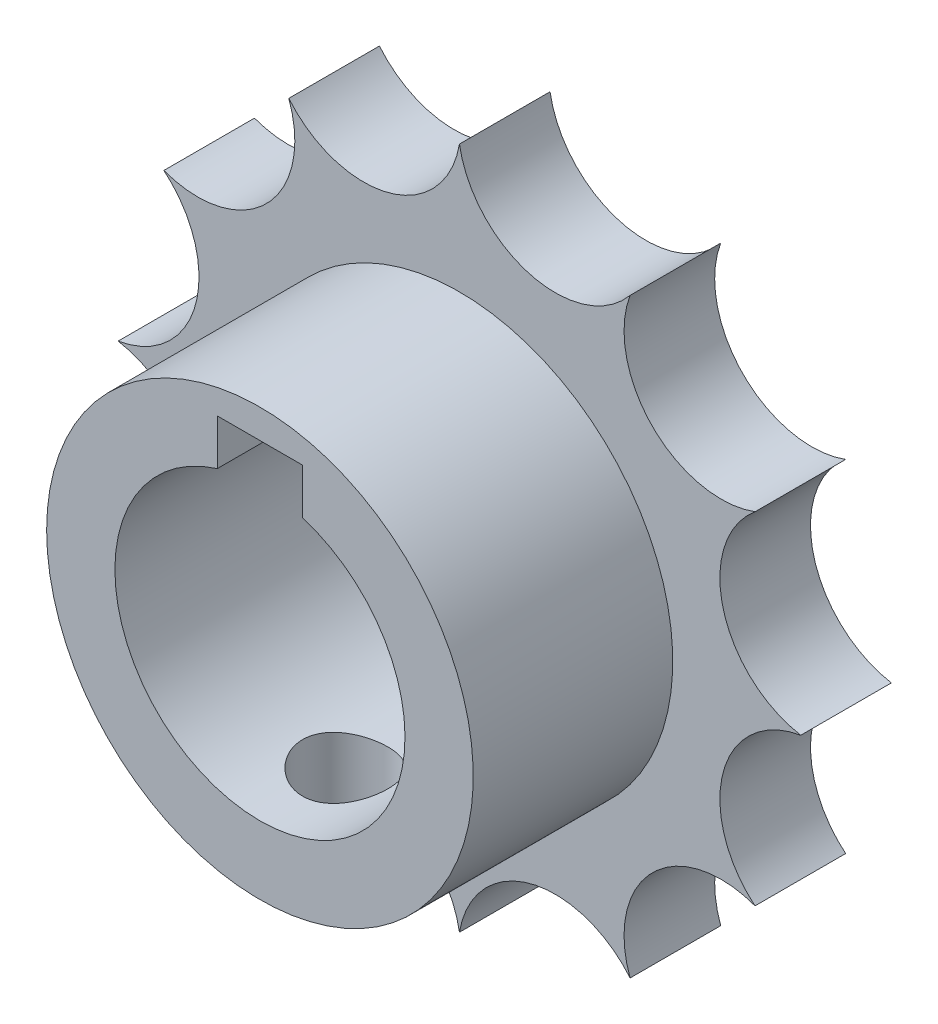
ISO-10303-21;
HEADER;
FILE_DESCRIPTION(('STEP AP214'),'2;1');
FILE_NAME('part.step','',(''),(''),'','','');
FILE_SCHEMA(('AUTOMOTIVE_DESIGN { 1 0 10303 214 1 1 1 1 }'));
ENDSEC;
DATA;
#1=APPLICATION_CONTEXT('core data for automotive mechanical design processes');
#2=APPLICATION_PROTOCOL_DEFINITION('international standard','automotive_design',2000,#1);
#3=PRODUCT_CONTEXT('',#1,'mechanical');
#4=PRODUCT('Part','Part','',(#3));
#5=PRODUCT_RELATED_PRODUCT_CATEGORY('part','',(#4));
#6=PRODUCT_DEFINITION_FORMATION('','',#4);
#7=PRODUCT_DEFINITION_CONTEXT('part definition',#1,'design');
#8=PRODUCT_DEFINITION('design','',#6,#7);
#9=PRODUCT_DEFINITION_SHAPE('','',#8);
#10=(LENGTH_UNIT() NAMED_UNIT(*) SI_UNIT(.MILLI.,.METRE.));
#11=(NAMED_UNIT(*) PLANE_ANGLE_UNIT() SI_UNIT($,.RADIAN.));
#12=(NAMED_UNIT(*) SI_UNIT($,.STERADIAN.) SOLID_ANGLE_UNIT());
#13=UNCERTAINTY_MEASURE_WITH_UNIT(LENGTH_MEASURE(1.E-05),#10,'distance_accuracy_value','');
#14=(GEOMETRIC_REPRESENTATION_CONTEXT(3) GLOBAL_UNCERTAINTY_ASSIGNED_CONTEXT((#13)) GLOBAL_UNIT_ASSIGNED_CONTEXT((#10,
#11,#12)) REPRESENTATION_CONTEXT('',''));
#15=CARTESIAN_POINT('',(0.,0.,0.));
#16=DIRECTION('',(0.,0.,1.));
#17=DIRECTION('',(1.,0.,0.));
#18=AXIS2_PLACEMENT_3D('',#15,#16,#17);
#19=CARTESIAN_POINT('',(-12.2034547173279,-7.35647207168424,0.));
#20=DIRECTION('',(0.,0.,-1.));
#21=DIRECTION('',(-1.,0.,0.));
#22=AXIS2_PLACEMENT_3D('',#19,#20,#21);
#23=PLANE('',#22);
#24=DIRECTION('',(0.,1.,0.));
#25=VECTOR('',#24,1.);
#26=CARTESIAN_POINT('',(-9.70345471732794,3.44352792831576,0.));
#27=LINE('',#26,#25);
#28=CARTESIAN_POINT('',(-9.70345471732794,0.767566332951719,0.));
#29=VERTEX_POINT('',#28);
#30=CARTESIAN_POINT('',(-9.70345471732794,3.44352792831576,0.));
#31=VERTEX_POINT('',#30);
#32=EDGE_CURVE('E151',#29,#31,#27,.T.);
#33=ORIENTED_EDGE('',*,*,#32,.T.);
#34=DIRECTION('',(1.,0.,0.));
#35=VECTOR('',#34,1.);
#36=CARTESIAN_POINT('',(-14.7034547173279,3.44352792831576,0.));
#37=LINE('',#36,#35);
#38=CARTESIAN_POINT('',(-14.7034547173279,3.44352792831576,0.));
#39=VERTEX_POINT('',#38);
#40=EDGE_CURVE('E199',#31,#39,#37,.F.);
#41=ORIENTED_EDGE('',*,*,#40,.T.);
#42=DIRECTION('',(0.,1.,0.));
#43=VECTOR('',#42,1.);
#44=CARTESIAN_POINT('',(-14.7034547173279,0.767566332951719,0.));
#45=LINE('',#44,#43);
#46=CARTESIAN_POINT('',(-14.7034547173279,0.767566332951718,0.));
#47=VERTEX_POINT('',#46);
#48=EDGE_CURVE('E195',#39,#47,#45,.F.);
#49=ORIENTED_EDGE('',*,*,#48,.T.);
#50=CARTESIAN_POINT('',(-12.2034547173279,-7.35647207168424,0.));
#51=DIRECTION('',(0.,0.,1.));
#52=DIRECTION('',(1.,0.,0.));
#53=AXIS2_PLACEMENT_3D('',#50,#51,#52);
#54=CIRCLE('',#53,8.5);
#55=EDGE_CURVE('E149',#47,#29,#54,.T.);
#56=ORIENTED_EDGE('',*,*,#55,.T.);
#57=EDGE_LOOP('',(#33,#41,#49,#56));
#58=FACE_BOUND('',#57,.T.);
#59=CARTESIAN_POINT('',(-27.5451557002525,7.98522891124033,0.));
#60=DIRECTION('',(0.,0.,1.));
#61=DIRECTION('',(1.,0.,0.));
#62=AXIS2_PLACEMENT_3D('',#59,#60,#61);
#63=CIRCLE('',#62,5.69644159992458);
#64=CARTESIAN_POINT('',(-29.5239627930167,2.64352792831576,0.));
#65=VERTEX_POINT('',#64);
#66=CARTESIAN_POINT('',(-22.2034547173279,9.96403600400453,0.));
#67=VERTEX_POINT('',#66);
#68=EDGE_CURVE('E161',#65,#67,#63,.T.);
#69=ORIENTED_EDGE('',*,*,#68,.T.);
#70=CARTESIAN_POINT('',(-17.818907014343,13.6006812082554,0.));
#71=DIRECTION('',(0.,0.,1.));
#72=DIRECTION('',(1.,0.,0.));
#73=AXIS2_PLACEMENT_3D('',#70,#71,#72);
#74=CIRCLE('',#73,5.69644159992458);
#75=CARTESIAN_POINT('',(-12.2034547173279,12.6435279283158,0.));
#76=VERTEX_POINT('',#75);
#77=EDGE_CURVE('E131',#67,#76,#74,.T.);
#78=ORIENTED_EDGE('',*,*,#77,.T.);
#79=CARTESIAN_POINT('',(-6.58800242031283,13.6006812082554,0.));
#80=DIRECTION('',(0.,0.,1.));
#81=DIRECTION('',(1.,0.,0.));
#82=AXIS2_PLACEMENT_3D('',#79,#80,#81);
#83=CIRCLE('',#82,5.69644159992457);
#84=CARTESIAN_POINT('',(-2.20345471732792,9.96403600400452,0.));
#85=VERTEX_POINT('',#84);
#86=EDGE_CURVE('E127',#76,#85,#83,.T.);
#87=ORIENTED_EDGE('',*,*,#86,.T.);
#88=CARTESIAN_POINT('',(3.13824626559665,7.98522891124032,0.));
#89=DIRECTION('',(0.,0.,1.));
#90=DIRECTION('',(1.,0.,0.));
#91=AXIS2_PLACEMENT_3D('',#88,#89,#90);
#92=CIRCLE('',#91,5.69644159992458);
#93=CARTESIAN_POINT('',(5.11705335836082,2.64352792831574,0.));
#94=VERTEX_POINT('',#93);
#95=EDGE_CURVE('E19',#85,#94,#92,.T.);
#96=ORIENTED_EDGE('',*,*,#95,.T.);
#97=CARTESIAN_POINT('',(8.75369856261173,-1.74101977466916,0.));
#98=DIRECTION('',(0.,0.,1.));
#99=DIRECTION('',(1.,0.,0.));
#100=AXIS2_PLACEMENT_3D('',#97,#98,#99);
#101=CIRCLE('',#100,5.69644159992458);
#102=CARTESIAN_POINT('',(7.79654528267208,-7.35647207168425,0.));
#103=VERTEX_POINT('',#102);
#104=EDGE_CURVE('E193',#94,#103,#101,.T.);
#105=ORIENTED_EDGE('',*,*,#104,.T.);
#106=CARTESIAN_POINT('',(8.75369856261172,-12.9719243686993,0.));
#107=DIRECTION('',(0.,0.,1.));
#108=DIRECTION('',(1.,0.,0.));
#109=AXIS2_PLACEMENT_3D('',#106,#107,#108);
#110=CIRCLE('',#109,5.69644159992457);
#111=CARTESIAN_POINT('',(5.11705335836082,-17.3564720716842,0.));
#112=VERTEX_POINT('',#111);
#113=EDGE_CURVE('E189',#103,#112,#110,.T.);
#114=ORIENTED_EDGE('',*,*,#113,.T.);
#115=CARTESIAN_POINT('',(3.13824626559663,-22.6981730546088,0.));
#116=DIRECTION('',(0.,0.,1.));
#117=DIRECTION('',(1.,0.,0.));
#118=AXIS2_PLACEMENT_3D('',#115,#116,#117);
#119=CIRCLE('',#118,5.69644159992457);
#120=CARTESIAN_POINT('',(-2.20345471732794,-24.676980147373,0.));
#121=VERTEX_POINT('',#120);
#122=EDGE_CURVE('E185',#112,#121,#119,.T.);
#123=ORIENTED_EDGE('',*,*,#122,.T.);
#124=CARTESIAN_POINT('',(-6.58800242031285,-28.3136253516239,0.));
#125=DIRECTION('',(0.,0.,1.));
#126=DIRECTION('',(1.,0.,0.));
#127=AXIS2_PLACEMENT_3D('',#124,#125,#126);
#128=CIRCLE('',#127,5.69644159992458);
#129=CARTESIAN_POINT('',(-12.2034547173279,-27.3564720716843,0.));
#130=VERTEX_POINT('',#129);
#131=EDGE_CURVE('E181',#121,#130,#128,.T.);
#132=ORIENTED_EDGE('',*,*,#131,.T.);
#133=CARTESIAN_POINT('',(-17.818907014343,-28.3136253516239,0.));
#134=DIRECTION('',(0.,0.,1.));
#135=DIRECTION('',(1.,0.,0.));
#136=AXIS2_PLACEMENT_3D('',#133,#134,#135);
#137=CIRCLE('',#136,5.69644159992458);
#138=CARTESIAN_POINT('',(-22.2034547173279,-24.676980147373,0.));
#139=VERTEX_POINT('',#138);
#140=EDGE_CURVE('E177',#130,#139,#137,.T.);
#141=ORIENTED_EDGE('',*,*,#140,.T.);
#142=CARTESIAN_POINT('',(-27.5451557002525,-22.6981730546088,0.));
#143=DIRECTION('',(0.,0.,1.));
#144=DIRECTION('',(1.,0.,0.));
#145=AXIS2_PLACEMENT_3D('',#142,#143,#144);
#146=CIRCLE('',#145,5.69644159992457);
#147=CARTESIAN_POINT('',(-29.5239627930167,-17.3564720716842,0.));
#148=VERTEX_POINT('',#147);
#149=EDGE_CURVE('E173',#139,#148,#146,.T.);
#150=ORIENTED_EDGE('',*,*,#149,.T.);
#151=CARTESIAN_POINT('',(-33.1606079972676,-12.9719243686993,0.));
#152=DIRECTION('',(0.,0.,1.));
#153=DIRECTION('',(1.,0.,0.));
#154=AXIS2_PLACEMENT_3D('',#151,#152,#153);
#155=CIRCLE('',#154,5.69644159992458);
#156=CARTESIAN_POINT('',(-32.2034547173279,-7.35647207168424,0.));
#157=VERTEX_POINT('',#156);
#158=EDGE_CURVE('E169',#148,#157,#155,.T.);
#159=ORIENTED_EDGE('',*,*,#158,.T.);
#160=CARTESIAN_POINT('',(-33.1606079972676,-1.74101977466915,0.));
#161=DIRECTION('',(0.,0.,1.));
#162=DIRECTION('',(1.,0.,0.));
#163=AXIS2_PLACEMENT_3D('',#160,#161,#162);
#164=CIRCLE('',#163,5.69644159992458);
#165=EDGE_CURVE('E165',#157,#65,#164,.T.);
#166=ORIENTED_EDGE('',*,*,#165,.T.);
#167=EDGE_LOOP('',(#69,#78,#87,#96,#105,#114,#123,#132,#141,#150,#159,#166));
#168=FACE_BOUND('',#167,.T.);
#169=ADVANCED_FACE('F16',(#58,#168),#23,.T.);
#170=CARTESIAN_POINT('',(3.13824626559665,7.98522891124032,0.));
#171=DIRECTION('',(0.,0.,1.));
#172=DIRECTION('',(1.,0.,0.));
#173=AXIS2_PLACEMENT_3D('',#170,#171,#172);
#174=CYLINDRICAL_SURFACE('',#173,5.69644159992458);
#175=DIRECTION('',(0.,0.,1.));
#176=VECTOR('',#175,1.);
#177=CARTESIAN_POINT('',(5.11705335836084,2.64352792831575,0.));
#178=LINE('',#177,#176);
#179=CARTESIAN_POINT('',(5.11705335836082,2.64352792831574,5.31));
#180=VERTEX_POINT('',#179);
#181=EDGE_CURVE('E143',#180,#94,#178,.F.);
#182=ORIENTED_EDGE('',*,*,#181,.T.);
#183=ORIENTED_EDGE('',*,*,#95,.F.);
#184=DIRECTION('',(0.,0.,1.));
#185=VECTOR('',#184,1.);
#186=CARTESIAN_POINT('',(-2.20345471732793,9.96403600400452,0.));
#187=LINE('',#186,#185);
#188=CARTESIAN_POINT('',(-2.20345471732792,9.96403600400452,5.31));
#189=VERTEX_POINT('',#188);
#190=EDGE_CURVE('E136',#85,#189,#187,.T.);
#191=ORIENTED_EDGE('',*,*,#190,.T.);
#192=CARTESIAN_POINT('',(3.13824626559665,7.98522891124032,5.31));
#193=DIRECTION('',(0.,0.,1.));
#194=DIRECTION('',(1.,0.,0.));
#195=AXIS2_PLACEMENT_3D('',#192,#193,#194);
#196=CIRCLE('',#195,5.69644159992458);
#197=EDGE_CURVE('E250',#189,#180,#196,.T.);
#198=ORIENTED_EDGE('',*,*,#197,.T.);
#199=EDGE_LOOP('',(#182,#183,#191,#198));
#200=FACE_BOUND('',#199,.T.);
#201=ADVANCED_FACE('F140',(#200),#174,.F.);
#202=CARTESIAN_POINT('',(8.75369856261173,-1.74101977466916,0.));
#203=DIRECTION('',(0.,0.,1.));
#204=DIRECTION('',(1.,0.,0.));
#205=AXIS2_PLACEMENT_3D('',#202,#203,#204);
#206=CYLINDRICAL_SURFACE('',#205,5.69644159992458);
#207=DIRECTION('',(0.,0.,1.));
#208=VECTOR('',#207,1.);
#209=CARTESIAN_POINT('',(7.79654528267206,-7.35647207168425,0.));
#210=LINE('',#209,#208);
#211=CARTESIAN_POINT('',(7.79654528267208,-7.35647207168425,5.31));
#212=VERTEX_POINT('',#211);
#213=EDGE_CURVE('E190',#212,#103,#210,.F.);
#214=ORIENTED_EDGE('',*,*,#213,.T.);
#215=ORIENTED_EDGE('',*,*,#104,.F.);
#216=ORIENTED_EDGE('',*,*,#181,.F.);
#217=CARTESIAN_POINT('',(8.75369856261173,-1.74101977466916,5.31));
#218=DIRECTION('',(0.,0.,1.));
#219=DIRECTION('',(1.,0.,0.));
#220=AXIS2_PLACEMENT_3D('',#217,#218,#219);
#221=CIRCLE('',#220,5.69644159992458);
#222=EDGE_CURVE('E437',#180,#212,#221,.T.);
#223=ORIENTED_EDGE('',*,*,#222,.T.);
#224=EDGE_LOOP('',(#214,#215,#216,#223));
#225=FACE_BOUND('',#224,.T.);
#226=ADVANCED_FACE('F315',(#225),#206,.F.);
#227=CARTESIAN_POINT('',(8.75369856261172,-12.9719243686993,0.));
#228=DIRECTION('',(0.,0.,1.));
#229=DIRECTION('',(1.,0.,0.));
#230=AXIS2_PLACEMENT_3D('',#227,#228,#229);
#231=CYLINDRICAL_SURFACE('',#230,5.69644159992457);
#232=DIRECTION('',(0.,0.,1.));
#233=VECTOR('',#232,1.);
#234=CARTESIAN_POINT('',(5.11705335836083,-17.3564720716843,0.));
#235=LINE('',#234,#233);
#236=CARTESIAN_POINT('',(5.11705335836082,-17.3564720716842,5.31));
#237=VERTEX_POINT('',#236);
#238=EDGE_CURVE('E186',#237,#112,#235,.F.);
#239=ORIENTED_EDGE('',*,*,#238,.T.);
#240=ORIENTED_EDGE('',*,*,#113,.F.);
#241=ORIENTED_EDGE('',*,*,#213,.F.);
#242=CARTESIAN_POINT('',(8.75369856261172,-12.9719243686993,5.31));
#243=DIRECTION('',(0.,0.,1.));
#244=DIRECTION('',(1.,0.,0.));
#245=AXIS2_PLACEMENT_3D('',#242,#243,#244);
#246=CIRCLE('',#245,5.69644159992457);
#247=EDGE_CURVE('E435',#212,#237,#246,.T.);
#248=ORIENTED_EDGE('',*,*,#247,.T.);
#249=EDGE_LOOP('',(#239,#240,#241,#248));
#250=FACE_BOUND('',#249,.T.);
#251=ADVANCED_FACE('F311',(#250),#231,.F.);
#252=CARTESIAN_POINT('',(3.13824626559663,-22.6981730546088,0.));
#253=DIRECTION('',(0.,0.,1.));
#254=DIRECTION('',(1.,0.,0.));
#255=AXIS2_PLACEMENT_3D('',#252,#253,#254);
#256=CYLINDRICAL_SURFACE('',#255,5.69644159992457);
#257=DIRECTION('',(0.,0.,1.));
#258=VECTOR('',#257,1.);
#259=CARTESIAN_POINT('',(-2.20345471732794,-24.676980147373,0.));
#260=LINE('',#259,#258);
#261=CARTESIAN_POINT('',(-2.20345471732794,-24.676980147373,5.31));
#262=VERTEX_POINT('',#261);
#263=EDGE_CURVE('E182',#262,#121,#260,.F.);
#264=ORIENTED_EDGE('',*,*,#263,.T.);
#265=ORIENTED_EDGE('',*,*,#122,.F.);
#266=ORIENTED_EDGE('',*,*,#238,.F.);
#267=CARTESIAN_POINT('',(3.13824626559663,-22.6981730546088,5.31));
#268=DIRECTION('',(0.,0.,1.));
#269=DIRECTION('',(1.,0.,0.));
#270=AXIS2_PLACEMENT_3D('',#267,#268,#269);
#271=CIRCLE('',#270,5.69644159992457);
#272=EDGE_CURVE('E433',#237,#262,#271,.T.);
#273=ORIENTED_EDGE('',*,*,#272,.T.);
#274=EDGE_LOOP('',(#264,#265,#266,#273));
#275=FACE_BOUND('',#274,.T.);
#276=ADVANCED_FACE('F307',(#275),#256,.F.);
#277=CARTESIAN_POINT('',(-6.58800242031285,-28.3136253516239,0.));
#278=DIRECTION('',(0.,0.,1.));
#279=DIRECTION('',(1.,0.,0.));
#280=AXIS2_PLACEMENT_3D('',#277,#278,#279);
#281=CYLINDRICAL_SURFACE('',#280,5.69644159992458);
#282=DIRECTION('',(0.,0.,1.));
#283=VECTOR('',#282,1.);
#284=CARTESIAN_POINT('',(-12.2034547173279,-27.3564720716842,0.));
#285=LINE('',#284,#283);
#286=CARTESIAN_POINT('',(-12.2034547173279,-27.3564720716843,5.31));
#287=VERTEX_POINT('',#286);
#288=EDGE_CURVE('E178',#287,#130,#285,.F.);
#289=ORIENTED_EDGE('',*,*,#288,.T.);
#290=ORIENTED_EDGE('',*,*,#131,.F.);
#291=ORIENTED_EDGE('',*,*,#263,.F.);
#292=CARTESIAN_POINT('',(-6.58800242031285,-28.3136253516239,5.31));
#293=DIRECTION('',(0.,0.,1.));
#294=DIRECTION('',(1.,0.,0.));
#295=AXIS2_PLACEMENT_3D('',#292,#293,#294);
#296=CIRCLE('',#295,5.69644159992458);
#297=EDGE_CURVE('E431',#262,#287,#296,.T.);
#298=ORIENTED_EDGE('',*,*,#297,.T.);
#299=EDGE_LOOP('',(#289,#290,#291,#298));
#300=FACE_BOUND('',#299,.T.);
#301=ADVANCED_FACE('F303',(#300),#281,.F.);
#302=CARTESIAN_POINT('',(-17.818907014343,-28.3136253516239,0.));
#303=DIRECTION('',(0.,0.,1.));
#304=DIRECTION('',(1.,0.,0.));
#305=AXIS2_PLACEMENT_3D('',#302,#303,#304);
#306=CYLINDRICAL_SURFACE('',#305,5.69644159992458);
#307=DIRECTION('',(0.,0.,1.));
#308=VECTOR('',#307,1.);
#309=CARTESIAN_POINT('',(-22.2034547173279,-24.676980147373,0.));
#310=LINE('',#309,#308);
#311=CARTESIAN_POINT('',(-22.2034547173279,-24.676980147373,5.31));
#312=VERTEX_POINT('',#311);
#313=EDGE_CURVE('E174',#312,#139,#310,.F.);
#314=ORIENTED_EDGE('',*,*,#313,.T.);
#315=ORIENTED_EDGE('',*,*,#140,.F.);
#316=ORIENTED_EDGE('',*,*,#288,.F.);
#317=CARTESIAN_POINT('',(-17.818907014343,-28.3136253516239,5.31));
#318=DIRECTION('',(0.,0.,1.));
#319=DIRECTION('',(1.,0.,0.));
#320=AXIS2_PLACEMENT_3D('',#317,#318,#319);
#321=CIRCLE('',#320,5.69644159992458);
#322=EDGE_CURVE('E429',#287,#312,#321,.T.);
#323=ORIENTED_EDGE('',*,*,#322,.T.);
#324=EDGE_LOOP('',(#314,#315,#316,#323));
#325=FACE_BOUND('',#324,.T.);
#326=ADVANCED_FACE('F299',(#325),#306,.F.);
#327=CARTESIAN_POINT('',(-27.5451557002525,-22.6981730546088,0.));
#328=DIRECTION('',(0.,0.,1.));
#329=DIRECTION('',(1.,0.,0.));
#330=AXIS2_PLACEMENT_3D('',#327,#328,#329);
#331=CYLINDRICAL_SURFACE('',#330,5.69644159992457);
#332=DIRECTION('',(0.,0.,1.));
#333=VECTOR('',#332,1.);
#334=CARTESIAN_POINT('',(-29.5239627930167,-17.3564720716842,0.));
#335=LINE('',#334,#333);
#336=CARTESIAN_POINT('',(-29.5239627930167,-17.3564720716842,5.31));
#337=VERTEX_POINT('',#336);
#338=EDGE_CURVE('E170',#337,#148,#335,.F.);
#339=ORIENTED_EDGE('',*,*,#338,.T.);
#340=ORIENTED_EDGE('',*,*,#149,.F.);
#341=ORIENTED_EDGE('',*,*,#313,.F.);
#342=CARTESIAN_POINT('',(-27.5451557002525,-22.6981730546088,5.31));
#343=DIRECTION('',(0.,0.,1.));
#344=DIRECTION('',(1.,0.,0.));
#345=AXIS2_PLACEMENT_3D('',#342,#343,#344);
#346=CIRCLE('',#345,5.69644159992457);
#347=EDGE_CURVE('E427',#312,#337,#346,.T.);
#348=ORIENTED_EDGE('',*,*,#347,.T.);
#349=EDGE_LOOP('',(#339,#340,#341,#348));
#350=FACE_BOUND('',#349,.T.);
#351=ADVANCED_FACE('F295',(#350),#331,.F.);
#352=CARTESIAN_POINT('',(-33.1606079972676,-12.9719243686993,0.));
#353=DIRECTION('',(0.,0.,1.));
#354=DIRECTION('',(1.,0.,0.));
#355=AXIS2_PLACEMENT_3D('',#352,#353,#354);
#356=CYLINDRICAL_SURFACE('',#355,5.69644159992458);
#357=DIRECTION('',(0.,0.,1.));
#358=VECTOR('',#357,1.);
#359=CARTESIAN_POINT('',(-32.2034547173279,-7.35647207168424,0.));
#360=LINE('',#359,#358);
#361=CARTESIAN_POINT('',(-32.2034547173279,-7.35647207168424,5.31));
#362=VERTEX_POINT('',#361);
#363=EDGE_CURVE('E166',#362,#157,#360,.F.);
#364=ORIENTED_EDGE('',*,*,#363,.T.);
#365=ORIENTED_EDGE('',*,*,#158,.F.);
#366=ORIENTED_EDGE('',*,*,#338,.F.);
#367=CARTESIAN_POINT('',(-33.1606079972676,-12.9719243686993,5.31));
#368=DIRECTION('',(0.,0.,1.));
#369=DIRECTION('',(1.,0.,0.));
#370=AXIS2_PLACEMENT_3D('',#367,#368,#369);
#371=CIRCLE('',#370,5.69644159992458);
#372=EDGE_CURVE('E425',#337,#362,#371,.T.);
#373=ORIENTED_EDGE('',*,*,#372,.T.);
#374=EDGE_LOOP('',(#364,#365,#366,#373));
#375=FACE_BOUND('',#374,.T.);
#376=ADVANCED_FACE('F291',(#375),#356,.F.);
#377=CARTESIAN_POINT('',(-33.1606079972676,-1.74101977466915,0.));
#378=DIRECTION('',(0.,0.,1.));
#379=DIRECTION('',(1.,0.,0.));
#380=AXIS2_PLACEMENT_3D('',#377,#378,#379);
#381=CYLINDRICAL_SURFACE('',#380,5.69644159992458);
#382=DIRECTION('',(0.,0.,1.));
#383=VECTOR('',#382,1.);
#384=CARTESIAN_POINT('',(-29.5239627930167,2.64352792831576,0.));
#385=LINE('',#384,#383);
#386=CARTESIAN_POINT('',(-29.5239627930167,2.64352792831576,5.31));
#387=VERTEX_POINT('',#386);
#388=EDGE_CURVE('E162',#387,#65,#385,.F.);
#389=ORIENTED_EDGE('',*,*,#388,.T.);
#390=ORIENTED_EDGE('',*,*,#165,.F.);
#391=ORIENTED_EDGE('',*,*,#363,.F.);
#392=CARTESIAN_POINT('',(-33.1606079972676,-1.74101977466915,5.31));
#393=DIRECTION('',(0.,0.,1.));
#394=DIRECTION('',(1.,0.,0.));
#395=AXIS2_PLACEMENT_3D('',#392,#393,#394);
#396=CIRCLE('',#395,5.69644159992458);
#397=EDGE_CURVE('E421',#362,#387,#396,.T.);
#398=ORIENTED_EDGE('',*,*,#397,.T.);
#399=EDGE_LOOP('',(#389,#390,#391,#398));
#400=FACE_BOUND('',#399,.T.);
#401=ADVANCED_FACE('F287',(#400),#381,.F.);
#402=CARTESIAN_POINT('',(-27.5451557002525,7.98522891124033,0.));
#403=DIRECTION('',(0.,0.,1.));
#404=DIRECTION('',(1.,0.,0.));
#405=AXIS2_PLACEMENT_3D('',#402,#403,#404);
#406=CYLINDRICAL_SURFACE('',#405,5.69644159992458);
#407=DIRECTION('',(0.,0.,1.));
#408=VECTOR('',#407,1.);
#409=CARTESIAN_POINT('',(-22.2034547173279,9.96403600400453,0.));
#410=LINE('',#409,#408);
#411=CARTESIAN_POINT('',(-22.2034547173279,9.96403600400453,5.31));
#412=VERTEX_POINT('',#411);
#413=EDGE_CURVE('E158',#412,#67,#410,.F.);
#414=ORIENTED_EDGE('',*,*,#413,.T.);
#415=ORIENTED_EDGE('',*,*,#68,.F.);
#416=ORIENTED_EDGE('',*,*,#388,.F.);
#417=CARTESIAN_POINT('',(-27.5451557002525,7.98522891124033,5.31));
#418=DIRECTION('',(0.,0.,1.));
#419=DIRECTION('',(1.,0.,0.));
#420=AXIS2_PLACEMENT_3D('',#417,#418,#419);
#421=CIRCLE('',#420,5.69644159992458);
#422=EDGE_CURVE('E419',#387,#412,#421,.T.);
#423=ORIENTED_EDGE('',*,*,#422,.T.);
#424=EDGE_LOOP('',(#414,#415,#416,#423));
#425=FACE_BOUND('',#424,.T.);
#426=ADVANCED_FACE('F283',(#425),#406,.F.);
#427=CARTESIAN_POINT('',(-17.818907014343,13.6006812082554,0.));
#428=DIRECTION('',(0.,0.,1.));
#429=DIRECTION('',(1.,0.,0.));
#430=AXIS2_PLACEMENT_3D('',#427,#428,#429);
#431=CYLINDRICAL_SURFACE('',#430,5.69644159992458);
#432=DIRECTION('',(0.,0.,1.));
#433=VECTOR('',#432,1.);
#434=CARTESIAN_POINT('',(-12.2034547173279,12.6435279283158,0.));
#435=LINE('',#434,#433);
#436=CARTESIAN_POINT('',(-12.2034547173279,12.6435279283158,5.31));
#437=VERTEX_POINT('',#436);
#438=EDGE_CURVE('E137',#437,#76,#435,.F.);
#439=ORIENTED_EDGE('',*,*,#438,.T.);
#440=ORIENTED_EDGE('',*,*,#77,.F.);
#441=ORIENTED_EDGE('',*,*,#413,.F.);
#442=CARTESIAN_POINT('',(-17.818907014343,13.6006812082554,5.31));
#443=DIRECTION('',(0.,0.,1.));
#444=DIRECTION('',(1.,0.,0.));
#445=AXIS2_PLACEMENT_3D('',#442,#443,#444);
#446=CIRCLE('',#445,5.69644159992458);
#447=EDGE_CURVE('E417',#412,#437,#446,.T.);
#448=ORIENTED_EDGE('',*,*,#447,.T.);
#449=EDGE_LOOP('',(#439,#440,#441,#448));
#450=FACE_BOUND('',#449,.T.);
#451=ADVANCED_FACE('F280',(#450),#431,.F.);
#452=CARTESIAN_POINT('',(-6.58800242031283,13.6006812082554,0.));
#453=DIRECTION('',(0.,0.,1.));
#454=DIRECTION('',(1.,0.,0.));
#455=AXIS2_PLACEMENT_3D('',#452,#453,#454);
#456=CYLINDRICAL_SURFACE('',#455,5.69644159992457);
#457=ORIENTED_EDGE('',*,*,#190,.F.);
#458=ORIENTED_EDGE('',*,*,#86,.F.);
#459=ORIENTED_EDGE('',*,*,#438,.F.);
#460=CARTESIAN_POINT('',(-6.58800242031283,13.6006812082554,5.31));
#461=DIRECTION('',(0.,0.,1.));
#462=DIRECTION('',(1.,0.,0.));
#463=AXIS2_PLACEMENT_3D('',#460,#461,#462);
#464=CIRCLE('',#463,5.69644159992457);
#465=EDGE_CURVE('E147',#437,#189,#464,.T.);
#466=ORIENTED_EDGE('',*,*,#465,.T.);
#467=EDGE_LOOP('',(#457,#458,#459,#466));
#468=FACE_BOUND('',#467,.T.);
#469=ADVANCED_FACE('F145',(#468),#456,.F.);
#470=CARTESIAN_POINT('',(-12.2034547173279,-7.35647207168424,0.));
#471=DIRECTION('',(0.,0.,1.));
#472=DIRECTION('',(1.,0.,0.));
#473=AXIS2_PLACEMENT_3D('',#470,#471,#472);
#474=CYLINDRICAL_SURFACE('',#473,8.5);
#475=CARTESIAN_POINT('',(-9.70345471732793,-15.4805104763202,12.));
#476=CARTESIAN_POINT('',(-9.70345675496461,-15.4805121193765,12.1371261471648));
#477=CARTESIAN_POINT('',(-9.71477525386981,-15.4840203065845,12.2742725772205));
#478=CARTESIAN_POINT('',(-9.75963934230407,-15.4976206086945,12.5445648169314));
#479=CARTESIAN_POINT('',(-9.79319302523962,-15.5077151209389,12.677709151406));
#480=CARTESIAN_POINT('',(-9.88129685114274,-15.5332480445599,12.9360458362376));
#481=CARTESIAN_POINT('',(-9.93581308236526,-15.5486778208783,13.0612506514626));
#482=CARTESIAN_POINT('',(-10.0641839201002,-15.583131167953,13.3007660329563));
#483=CARTESIAN_POINT('',(-10.1380411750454,-15.6021552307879,13.4150751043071));
#484=CARTESIAN_POINT('',(-10.3054022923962,-15.6423025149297,13.6330310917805));
#485=CARTESIAN_POINT('',(-10.39939128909,-15.6634691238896,13.736297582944));
#486=CARTESIAN_POINT('',(-10.6033075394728,-15.7051452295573,13.9258534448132));
#487=CARTESIAN_POINT('',(-10.7132367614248,-15.7256546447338,14.0121407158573));
#488=CARTESIAN_POINT('',(-10.9486066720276,-15.7641967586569,14.1669285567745));
#489=CARTESIAN_POINT('',(-11.0743114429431,-15.7821723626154,14.2350430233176));
#490=CARTESIAN_POINT('',(-11.3360090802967,-15.8131185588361,14.3490198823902));
#491=CARTESIAN_POINT('',(-11.4719998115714,-15.8260901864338,14.3948868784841));
#492=CARTESIAN_POINT('',(-11.7464307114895,-15.8452599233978,14.4618129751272));
#493=CARTESIAN_POINT('',(-11.8847000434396,-15.8516348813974,14.4835210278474));
#494=CARTESIAN_POINT('',(-12.1630553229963,-15.8575149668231,14.5035631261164));
#495=CARTESIAN_POINT('',(-12.3031408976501,-15.8570214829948,14.5019018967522));
#496=CARTESIAN_POINT('',(-12.5766060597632,-15.8493461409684,14.475692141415));
#497=CARTESIAN_POINT('',(-12.7100596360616,-15.8423695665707,14.4518460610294));
#498=CARTESIAN_POINT('',(-12.9709795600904,-15.8227600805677,14.3830886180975));
#499=CARTESIAN_POINT('',(-13.0984455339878,-15.810126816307,14.3381759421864));
#500=CARTESIAN_POINT('',(-13.3454643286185,-15.7803358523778,14.228073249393));
#501=CARTESIAN_POINT('',(-13.4649108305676,-15.7631283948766,14.1626587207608));
#502=CARTESIAN_POINT('',(-13.6913589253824,-15.7260196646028,14.0135857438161));
#503=CARTESIAN_POINT('',(-13.7983576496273,-15.7061177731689,13.929923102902));
#504=CARTESIAN_POINT('',(-14.0010658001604,-15.6648833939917,13.7430693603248));
#505=CARTESIAN_POINT('',(-14.0962089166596,-15.6435252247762,13.6392687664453));
#506=CARTESIAN_POINT('',(-14.2678936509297,-15.6024350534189,13.4169744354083));
#507=CARTESIAN_POINT('',(-14.344433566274,-15.5827032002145,13.2984793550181));
#508=CARTESIAN_POINT('',(-14.4772993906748,-15.5469803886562,13.048717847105));
#509=CARTESIAN_POINT('',(-14.53343930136,-15.5310242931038,12.917347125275));
#510=CARTESIAN_POINT('',(-14.6226354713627,-15.5050760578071,12.6464394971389));
#511=CARTESIAN_POINT('',(-14.655698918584,-15.4950820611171,12.5069051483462));
#512=CARTESIAN_POINT('',(-14.6967604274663,-15.4825949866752,12.2290040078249));
#513=CARTESIAN_POINT('',(-14.7056163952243,-15.4798453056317,12.0907753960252));
#514=CARTESIAN_POINT('',(-14.7004014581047,-15.4814499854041,11.8148052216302));
#515=CARTESIAN_POINT('',(-14.6863336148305,-15.4858033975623,11.6770635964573));
#516=CARTESIAN_POINT('',(-14.6364330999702,-15.5008726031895,11.4095042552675));
#517=CARTESIAN_POINT('',(-14.6011460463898,-15.5114287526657,11.2795748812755));
#518=CARTESIAN_POINT('',(-14.5104378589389,-15.5375503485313,11.0274873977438));
#519=CARTESIAN_POINT('',(-14.4550136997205,-15.5531165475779,10.9053304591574));
#520=CARTESIAN_POINT('',(-14.3239565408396,-15.5880072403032,10.6687477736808));
#521=CARTESIAN_POINT('',(-14.2478360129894,-15.6074188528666,10.554605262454));
#522=CARTESIAN_POINT('',(-14.0781304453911,-15.647622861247,10.340400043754));
#523=CARTESIAN_POINT('',(-13.9845413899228,-15.6684155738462,10.2403405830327));
#524=CARTESIAN_POINT('',(-13.7785338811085,-15.7099467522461,10.0534248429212));
#525=CARTESIAN_POINT('',(-13.6655579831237,-15.730656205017,9.96717503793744));
#526=CARTESIAN_POINT('',(-13.4262468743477,-15.7689295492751,9.81484718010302));
#527=CARTESIAN_POINT('',(-13.2999123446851,-15.786493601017,9.74876809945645));
#528=CARTESIAN_POINT('',(-13.0383244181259,-15.8163876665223,9.63929347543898));
#529=CARTESIAN_POINT('',(-12.9031472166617,-15.8287569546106,9.59572712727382));
#530=CARTESIAN_POINT('',(-12.6269630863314,-15.8470413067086,9.53206394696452));
#531=CARTESIAN_POINT('',(-12.4859577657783,-15.8529581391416,9.51196068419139));
#532=CARTESIAN_POINT('',(-12.2077353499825,-15.8575676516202,9.49626785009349));
#533=CARTESIAN_POINT('',(-12.0705716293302,-15.8565200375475,9.49979705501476));
#534=CARTESIAN_POINT('',(-11.7988748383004,-15.8479259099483,9.52917351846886));
#535=CARTESIAN_POINT('',(-11.664341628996,-15.8403797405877,9.5550195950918));
#536=CARTESIAN_POINT('',(-11.4030246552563,-15.8197065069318,9.62775860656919));
#537=CARTESIAN_POINT('',(-11.2761770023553,-15.8066358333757,9.674439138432));
#538=CARTESIAN_POINT('',(-11.0320462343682,-15.7762672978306,9.78733254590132));
#539=CARTESIAN_POINT('',(-10.9147646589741,-15.758968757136,9.8535485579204));
#540=CARTESIAN_POINT('',(-10.6891360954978,-15.7212994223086,10.0060215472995));
#541=CARTESIAN_POINT('',(-10.5811799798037,-15.7008498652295,10.092837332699));
#542=CARTESIAN_POINT('',(-10.3810729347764,-15.6594466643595,10.2830294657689));
#543=CARTESIAN_POINT('',(-10.2889264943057,-15.6384928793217,10.3864105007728));
#544=CARTESIAN_POINT('',(-10.1204403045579,-15.5977578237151,10.6103132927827));
#545=CARTESIAN_POINT('',(-10.0446219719,-15.5780265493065,10.731237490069));
#546=CARTESIAN_POINT('',(-9.91448380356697,-15.5427523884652,10.9846778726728));
#547=CARTESIAN_POINT('',(-9.86015291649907,-15.5272073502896,11.1171880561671));
#548=CARTESIAN_POINT('',(-9.77984484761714,-15.5037201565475,11.3738930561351));
#549=CARTESIAN_POINT('',(-9.75127520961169,-15.4950964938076,11.4972192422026));
#550=CARTESIAN_POINT('',(-9.71308092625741,-15.4834914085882,11.7470249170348));
#551=CARTESIAN_POINT('',(-9.70345283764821,-15.4805089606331,11.8735038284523));
#552=CARTESIAN_POINT('',(-9.70345471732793,-15.4805104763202,12.));
#553=B_SPLINE_CURVE_WITH_KNOTS('',3,(#475,#476,#477,#478,#479,#480,#481,#482,#483,#484,#485,
#486,#487,#488,#489,#490,#491,#492,#493,#494,#495,#496,#497,#498,#499,#500,#501,#502,#503,#504,
#505,#506,#507,#508,#509,#510,#511,#512,#513,#514,#515,#516,#517,#518,#519,#520,#521,#522,#523,
#524,#525,#526,#527,#528,#529,#530,#531,#532,#533,#534,#535,#536,#537,#538,#539,#540,#541,#542,
#543,#544,#545,#546,#547,#548,#549,#550,#551,#552),.UNSPECIFIED.,.T.,.F.,(4,2,2,2,2,2,2,2,2,2,2,
2,2,2,2,2,2,2,2,2,2,2,2,2,2,2,2,2,2,2,2,2,2,2,2,2,2,2,4),(0.,0.410912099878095,
0.821973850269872,1.23237339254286,1.64282916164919,2.06459109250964,2.48640514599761,
2.91657307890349,3.34665196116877,3.76487622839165,4.18301593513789,4.58835076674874,
4.99371087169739,5.40367496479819,5.81373334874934,6.23900922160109,6.66432399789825,
7.09342468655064,7.52239165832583,7.93594602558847,8.34944516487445,8.75274111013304,
9.15609767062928,9.56993137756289,9.98386033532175,10.4127208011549,10.8415594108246,
11.2670947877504,11.6925135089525,12.1021596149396,12.5117840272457,12.9173245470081,
13.3229302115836,13.7411394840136,14.1594673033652,14.5896395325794,15.0195902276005,
15.3987174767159,15.7777758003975),.UNSPECIFIED.);
#554=CARTESIAN_POINT('',(-9.70345471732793,-15.4805104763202,12.));
#555=VERTEX_POINT('',#554);
#556=EDGE_CURVE('E264',#555,#555,#553,.T.);
#557=ORIENTED_EDGE('',*,*,#556,.T.);
#558=EDGE_LOOP('',(#557));
#559=FACE_BOUND('',#558,.T.);
#560=DIRECTION('',(0.,0.,-1.));
#561=VECTOR('',#560,1.);
#562=CARTESIAN_POINT('',(-9.70345471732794,0.767566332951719,0.));
#563=LINE('',#562,#561);
#564=CARTESIAN_POINT('',(-9.70345471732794,0.767566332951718,17.));
#565=VERTEX_POINT('',#564);
#566=EDGE_CURVE('E155',#565,#29,#563,.T.);
#567=ORIENTED_EDGE('',*,*,#566,.T.);
#568=ORIENTED_EDGE('',*,*,#55,.F.);
#569=DIRECTION('',(0.,0.,1.));
#570=VECTOR('',#569,1.);
#571=CARTESIAN_POINT('',(-14.7034547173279,0.767566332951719,0.));
#572=LINE('',#571,#570);
#573=CARTESIAN_POINT('',(-14.7034547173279,0.767566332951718,17.));
#574=VERTEX_POINT('',#573);
#575=EDGE_CURVE('E197',#47,#574,#572,.T.);
#576=ORIENTED_EDGE('',*,*,#575,.T.);
#577=CARTESIAN_POINT('',(-12.2034547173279,-7.35647207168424,17.));
#578=DIRECTION('',(0.,0.,1.));
#579=DIRECTION('',(1.,0.,0.));
#580=AXIS2_PLACEMENT_3D('',#577,#578,#579);
#581=CIRCLE('',#580,8.5);
#582=EDGE_CURVE('E248',#574,#565,#581,.T.);
#583=ORIENTED_EDGE('',*,*,#582,.T.);
#584=EDGE_LOOP('',(#567,#568,#576,#583));
#585=FACE_BOUND('',#584,.T.);
#586=ADVANCED_FACE('F263',(#559,#585),#474,.F.);
#587=CARTESIAN_POINT('',(-9.70345471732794,3.44352792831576,0.));
#588=DIRECTION('',(1.,0.,0.));
#589=DIRECTION('',(0.,0.,-1.));
#590=AXIS2_PLACEMENT_3D('',#587,#588,#589);
#591=PLANE('',#590);
#592=DIRECTION('',(0.,1.,0.));
#593=VECTOR('',#592,1.);
#594=CARTESIAN_POINT('',(-9.70345471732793,-7.35647207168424,17.));
#595=LINE('',#594,#593);
#596=CARTESIAN_POINT('',(-9.70345471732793,3.44352792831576,17.));
#597=VERTEX_POINT('',#596);
#598=EDGE_CURVE('E244',#565,#597,#595,.T.);
#599=ORIENTED_EDGE('',*,*,#598,.T.);
#600=DIRECTION('',(0.,0.,1.));
#601=VECTOR('',#600,1.);
#602=CARTESIAN_POINT('',(-9.70345471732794,3.44352792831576,0.));
#603=LINE('',#602,#601);
#604=EDGE_CURVE('E201',#597,#31,#603,.F.);
#605=ORIENTED_EDGE('',*,*,#604,.T.);
#606=ORIENTED_EDGE('',*,*,#32,.F.);
#607=ORIENTED_EDGE('',*,*,#566,.F.);
#608=EDGE_LOOP('',(#599,#605,#606,#607));
#609=FACE_BOUND('',#608,.T.);
#610=ADVANCED_FACE('F255',(#609),#591,.F.);
#611=CARTESIAN_POINT('',(-14.7034547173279,3.44352792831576,0.));
#612=DIRECTION('',(0.,1.,0.));
#613=DIRECTION('',(0.,0.,1.));
#614=AXIS2_PLACEMENT_3D('',#611,#612,#613);
#615=PLANE('',#614);
#616=DIRECTION('',(-1.,0.,0.));
#617=VECTOR('',#616,1.);
#618=CARTESIAN_POINT('',(-12.2034547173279,3.44352792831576,17.));
#619=LINE('',#618,#617);
#620=CARTESIAN_POINT('',(-14.7034547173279,3.44352792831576,17.));
#621=VERTEX_POINT('',#620);
#622=EDGE_CURVE('E34',#597,#621,#619,.T.);
#623=ORIENTED_EDGE('',*,*,#622,.T.);
#624=DIRECTION('',(0.,0.,1.));
#625=VECTOR('',#624,1.);
#626=CARTESIAN_POINT('',(-14.7034547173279,3.44352792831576,0.));
#627=LINE('',#626,#625);
#628=EDGE_CURVE('E198',#621,#39,#627,.F.);
#629=ORIENTED_EDGE('',*,*,#628,.T.);
#630=ORIENTED_EDGE('',*,*,#40,.F.);
#631=ORIENTED_EDGE('',*,*,#604,.F.);
#632=EDGE_LOOP('',(#623,#629,#630,#631));
#633=FACE_BOUND('',#632,.T.);
#634=ADVANCED_FACE('F257',(#633),#615,.F.);
#635=CARTESIAN_POINT('',(-14.7034547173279,0.767566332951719,0.));
#636=DIRECTION('',(-1.,0.,0.));
#637=DIRECTION('',(0.,0.,1.));
#638=AXIS2_PLACEMENT_3D('',#635,#636,#637);
#639=PLANE('',#638);
#640=ORIENTED_EDGE('',*,*,#48,.F.);
#641=ORIENTED_EDGE('',*,*,#628,.F.);
#642=DIRECTION('',(0.,1.,0.));
#643=VECTOR('',#642,1.);
#644=CARTESIAN_POINT('',(-14.7034547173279,-7.35647207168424,17.));
#645=LINE('',#644,#643);
#646=EDGE_CURVE('E238',#621,#574,#645,.F.);
#647=ORIENTED_EDGE('',*,*,#646,.T.);
#648=ORIENTED_EDGE('',*,*,#575,.F.);
#649=EDGE_LOOP('',(#640,#641,#647,#648));
#650=FACE_BOUND('',#649,.T.);
#651=ADVANCED_FACE('F392',(#650),#639,.F.);
#652=CARTESIAN_POINT('',(-12.2034547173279,-7.35647207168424,5.31));
#653=DIRECTION('',(0.,0.,-1.));
#654=DIRECTION('',(-1.,0.,0.));
#655=AXIS2_PLACEMENT_3D('',#652,#653,#654);
#656=PLANE('',#655);
#657=CARTESIAN_POINT('',(-12.2034547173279,-7.35647207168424,5.31));
#658=DIRECTION('',(0.,0.,-1.));
#659=DIRECTION('',(-1.,0.,0.));
#660=AXIS2_PLACEMENT_3D('',#657,#658,#659);
#661=CIRCLE('',#660,12.5);
#662=CARTESIAN_POINT('',(-24.7034547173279,-7.35647207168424,5.31));
#663=VERTEX_POINT('',#662);
#664=EDGE_CURVE('E209',#663,#663,#661,.F.);
#665=ORIENTED_EDGE('',*,*,#664,.F.);
#666=EDGE_LOOP('',(#665));
#667=FACE_BOUND('',#666,.T.);
#668=ORIENTED_EDGE('',*,*,#447,.F.);
#669=ORIENTED_EDGE('',*,*,#422,.F.);
#670=ORIENTED_EDGE('',*,*,#397,.F.);
#671=ORIENTED_EDGE('',*,*,#372,.F.);
#672=ORIENTED_EDGE('',*,*,#347,.F.);
#673=ORIENTED_EDGE('',*,*,#322,.F.);
#674=ORIENTED_EDGE('',*,*,#297,.F.);
#675=ORIENTED_EDGE('',*,*,#272,.F.);
#676=ORIENTED_EDGE('',*,*,#247,.F.);
#677=ORIENTED_EDGE('',*,*,#222,.F.);
#678=ORIENTED_EDGE('',*,*,#197,.F.);
#679=ORIENTED_EDGE('',*,*,#465,.F.);
#680=EDGE_LOOP('',(#668,#669,#670,#671,#672,#673,#674,#675,#676,#677,#678,#679));
#681=FACE_BOUND('',#680,.T.);
#682=ADVANCED_FACE('F226',(#667,#681),#656,.F.);
#683=CARTESIAN_POINT('',(-12.2034547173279,3.44352792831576,12.));
#684=DIRECTION('',(0.,-1.,0.));
#685=DIRECTION('',(1.,0.,0.));
#686=AXIS2_PLACEMENT_3D('',#683,#684,#685);
#687=CYLINDRICAL_SURFACE('',#686,2.5);
#688=ORIENTED_EDGE('',*,*,#556,.F.);
#689=EDGE_LOOP('',(#688));
#690=FACE_BOUND('',#689,.T.);
#691=CARTESIAN_POINT('',(-14.7034547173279,-19.6039207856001,12.));
#692=CARTESIAN_POINT('',(-14.7034495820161,-19.6039235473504,12.1389109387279));
#693=CARTESIAN_POINT('',(-14.6918376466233,-19.6063097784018,12.2778865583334));
#694=CARTESIAN_POINT('',(-14.645735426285,-19.6155828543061,12.5519062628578));
#695=CARTESIAN_POINT('',(-14.6112268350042,-19.6224733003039,12.68694711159));
#696=CARTESIAN_POINT('',(-14.5204441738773,-19.6399439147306,12.9490932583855));
#697=CARTESIAN_POINT('',(-14.4641917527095,-19.6505204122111,13.0762063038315));
#698=CARTESIAN_POINT('',(-14.3315774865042,-19.6741670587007,13.3191871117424));
#699=CARTESIAN_POINT('',(-14.2552167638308,-19.6872370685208,13.4350555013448));
#700=CARTESIAN_POINT('',(-14.0834024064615,-19.7146045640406,13.6539025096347));
#701=CARTESIAN_POINT('',(-13.9877188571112,-19.7289155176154,13.7566989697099));
#702=CARTESIAN_POINT('',(-13.7804716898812,-19.7570338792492,13.9448938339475));
#703=CARTESIAN_POINT('',(-13.6689069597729,-19.770841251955,14.030291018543));
#704=CARTESIAN_POINT('',(-13.4318581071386,-19.7965419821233,14.1819700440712));
#705=CARTESIAN_POINT('',(-13.3062611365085,-19.808417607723,14.2480787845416));
#706=CARTESIAN_POINT('',(-13.0454650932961,-19.828765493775,14.3581873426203));
#707=CARTESIAN_POINT('',(-12.9102669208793,-19.8372380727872,14.4021892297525));
#708=CARTESIAN_POINT('',(-12.6359966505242,-19.8497300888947,14.4662679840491));
#709=CARTESIAN_POINT('',(-12.496999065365,-19.8538067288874,14.4866524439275));
#710=CARTESIAN_POINT('',(-12.2175011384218,-19.8572451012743,14.5038773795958));
#711=CARTESIAN_POINT('',(-12.0770009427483,-19.8566072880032,14.5007201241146));
#712=CARTESIAN_POINT('',(-11.800599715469,-19.8507329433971,14.4711845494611));
#713=CARTESIAN_POINT('',(-11.6646616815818,-19.8455620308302,14.4451375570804));
#714=CARTESIAN_POINT('',(-11.3991256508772,-19.8312765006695,14.3710874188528));
#715=CARTESIAN_POINT('',(-11.2695279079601,-19.8221617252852,14.3230833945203));
#716=CARTESIAN_POINT('',(-11.0194060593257,-19.8009044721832,14.2061748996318));
#717=CARTESIAN_POINT('',(-10.8989442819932,-19.7887432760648,14.1371406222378));
#718=CARTESIAN_POINT('',(-10.6711921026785,-19.7627338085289,13.9802273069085));
#719=CARTESIAN_POINT('',(-10.5639032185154,-19.7488853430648,13.8923461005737));
#720=CARTESIAN_POINT('',(-10.3635761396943,-19.7207461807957,13.6984159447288));
#721=CARTESIAN_POINT('',(-10.2708189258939,-19.7064519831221,13.592077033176));
#722=CARTESIAN_POINT('',(-10.1044084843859,-19.6792613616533,13.3652088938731));
#723=CARTESIAN_POINT('',(-10.0307556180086,-19.6663649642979,13.244679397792));
#724=CARTESIAN_POINT('',(-9.90454768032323,-19.6434232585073,12.9924479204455));
#725=CARTESIAN_POINT('',(-9.85203809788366,-19.633384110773,12.8607225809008));
#726=CARTESIAN_POINT('',(-9.76997886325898,-19.6173839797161,12.59007169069));
#727=CARTESIAN_POINT('',(-9.74042621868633,-19.6114224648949,12.4511470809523));
#728=CARTESIAN_POINT('',(-9.70553970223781,-19.6043590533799,12.1725878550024));
#729=CARTESIAN_POINT('',(-9.69980007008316,-19.6031757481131,12.0330060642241));
#730=CARTESIAN_POINT('',(-9.71161064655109,-19.6055842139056,11.7548794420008));
#731=CARTESIAN_POINT('',(-9.72915953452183,-19.6091757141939,11.6163345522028));
#732=CARTESIAN_POINT('',(-9.78669919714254,-19.6206528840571,11.3455783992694));
#733=CARTESIAN_POINT('',(-9.82647316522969,-19.6284970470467,11.2133191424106));
#734=CARTESIAN_POINT('',(-9.92710212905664,-19.6475593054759,10.9573418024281));
#735=CARTESIAN_POINT('',(-9.987958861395,-19.658777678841,10.8336244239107));
#736=CARTESIAN_POINT('',(-10.1299443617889,-19.6835072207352,10.5964672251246));
#737=CARTESIAN_POINT('',(-10.2113270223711,-19.6970463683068,10.4831823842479));
#738=CARTESIAN_POINT('',(-10.3917157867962,-19.7248151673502,10.2717292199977));
#739=CARTESIAN_POINT('',(-10.4907237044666,-19.7390448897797,10.1735624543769));
#740=CARTESIAN_POINT('',(-10.7053740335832,-19.7668557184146,9.99359360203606));
#741=CARTESIAN_POINT('',(-10.8212484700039,-19.7804235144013,9.91206586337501));
#742=CARTESIAN_POINT('',(-11.0652849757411,-19.8051502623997,9.76963529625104));
#743=CARTESIAN_POINT('',(-11.1934465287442,-19.8163093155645,9.70873160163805));
#744=CARTESIAN_POINT('',(-11.4576980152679,-19.8349044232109,9.60967782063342));
#745=CARTESIAN_POINT('',(-11.5937380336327,-19.8423615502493,9.57139870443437));
#746=CARTESIAN_POINT('',(-11.8704810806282,-19.8528029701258,9.51827188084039));
#747=CARTESIAN_POINT('',(-12.0111835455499,-19.8557878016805,9.50342135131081));
#748=CARTESIAN_POINT('',(-12.290636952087,-19.8569355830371,9.49768254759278));
#749=CARTESIAN_POINT('',(-12.4293792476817,-19.8551815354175,9.50638179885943));
#750=CARTESIAN_POINT('',(-12.7033822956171,-19.8472231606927,9.54658487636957));
#751=CARTESIAN_POINT('',(-12.8386430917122,-19.841018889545,9.57808841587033));
#752=CARTESIAN_POINT('',(-13.1015865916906,-19.8248595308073,9.66282248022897));
#753=CARTESIAN_POINT('',(-13.2292858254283,-19.8149130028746,9.71600344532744));
#754=CARTESIAN_POINT('',(-13.4740077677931,-19.7923401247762,9.84253060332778));
#755=CARTESIAN_POINT('',(-13.5910296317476,-19.7797135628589,9.91587838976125));
#756=CARTESIAN_POINT('',(-13.8131144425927,-19.7529120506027,10.0820484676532));
#757=CARTESIAN_POINT('',(-13.917954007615,-19.7387154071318,10.1751658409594));
#758=CARTESIAN_POINT('',(-14.1106612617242,-19.7105026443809,10.3776256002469));
#759=CARTESIAN_POINT('',(-14.1985249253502,-19.6964865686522,10.4869718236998));
#760=CARTESIAN_POINT('',(-14.3556852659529,-19.6700556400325,10.7201982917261));
#761=CARTESIAN_POINT('',(-14.4247717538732,-19.6576596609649,10.8442224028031));
#762=CARTESIAN_POINT('',(-14.5410148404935,-19.6361029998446,11.1023319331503));
#763=CARTESIAN_POINT('',(-14.5881913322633,-19.6269393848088,11.236408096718));
#764=CARTESIAN_POINT('',(-14.6501275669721,-19.6147141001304,11.4756561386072));
#765=CARTESIAN_POINT('',(-14.6700894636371,-19.6106916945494,11.5794635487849));
#766=CARTESIAN_POINT('',(-14.6967547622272,-19.6052940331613,11.7888348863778));
#767=CARTESIAN_POINT('',(-14.7034586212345,-19.6039186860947,11.8943987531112));
#768=CARTESIAN_POINT('',(-14.7034547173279,-19.6039207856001,12.));
#769=B_SPLINE_CURVE_WITH_KNOTS('',3,(#691,#692,#693,#694,#695,#696,#697,#698,#699,#700,#701,
#702,#703,#704,#705,#706,#707,#708,#709,#710,#711,#712,#713,#714,#715,#716,#717,#718,#719,#720,
#721,#722,#723,#724,#725,#726,#727,#728,#729,#730,#731,#732,#733,#734,#735,#736,#737,#738,#739,
#740,#741,#742,#743,#744,#745,#746,#747,#748,#749,#750,#751,#752,#753,#754,#755,#756,#757,#758,
#759,#760,#761,#762,#763,#764,#765,#766,#767,#768),.UNSPECIFIED.,.T.,.F.,(4,2,2,2,2,2,2,2,2,2,2,
2,2,2,2,2,2,2,2,2,2,2,2,2,2,2,2,2,2,2,2,2,2,2,2,2,2,2,4),(0.,0.416346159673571,
0.833025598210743,1.24929124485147,1.66553366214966,2.08705631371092,2.50860850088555,
2.93383501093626,3.359021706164,3.77860622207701,4.19815030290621,4.61171974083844,
5.02530572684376,5.44149810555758,5.85773839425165,6.28123366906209,6.70473695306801,
7.12914657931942,7.55350087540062,7.97059394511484,8.38766336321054,8.80073354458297,
9.21383775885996,9.63232649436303,10.0508583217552,10.4758150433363,10.9007539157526,
11.3232453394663,11.7456858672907,12.1607754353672,12.5758597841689,12.9900004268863,
13.4041738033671,13.8250288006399,14.2459834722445,14.6714724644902,15.096574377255,
15.413095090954,15.729604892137),.UNSPECIFIED.);
#770=CARTESIAN_POINT('',(-14.7034547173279,-19.6039207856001,12.));
#771=VERTEX_POINT('',#770);
#772=EDGE_CURVE('E25',#771,#771,#769,.T.);
#773=ORIENTED_EDGE('',*,*,#772,.F.);
#774=EDGE_LOOP('',(#773));
#775=FACE_BOUND('',#774,.T.);
#776=ADVANCED_FACE('F211',(#690,#775),#687,.F.);
#777=CARTESIAN_POINT('',(-12.2034547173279,-7.35647207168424,17.));
#778=DIRECTION('',(0.,0.,-1.));
#779=DIRECTION('',(-1.,0.,0.));
#780=AXIS2_PLACEMENT_3D('',#777,#778,#779);
#781=PLANE('',#780);
#782=ORIENTED_EDGE('',*,*,#622,.F.);
#783=ORIENTED_EDGE('',*,*,#598,.F.);
#784=ORIENTED_EDGE('',*,*,#582,.F.);
#785=ORIENTED_EDGE('',*,*,#646,.F.);
#786=EDGE_LOOP('',(#782,#783,#784,#785));
#787=FACE_BOUND('',#786,.T.);
#788=CARTESIAN_POINT('',(-12.2034547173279,-7.35647207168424,17.));
#789=DIRECTION('',(0.,0.,-1.));
#790=DIRECTION('',(-1.,0.,0.));
#791=AXIS2_PLACEMENT_3D('',#788,#789,#790);
#792=CIRCLE('',#791,12.5);
#793=CARTESIAN_POINT('',(-24.7034547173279,-7.35647207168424,17.));
#794=VERTEX_POINT('',#793);
#795=EDGE_CURVE('E11',#794,#794,#792,.T.);
#796=ORIENTED_EDGE('',*,*,#795,.F.);
#797=EDGE_LOOP('',(#796));
#798=FACE_BOUND('',#797,.T.);
#799=ADVANCED_FACE('F218',(#787,#798),#781,.F.);
#800=CARTESIAN_POINT('',(-12.2034547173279,-7.35647207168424,17.));
#801=DIRECTION('',(0.,0.,-1.));
#802=DIRECTION('',(-1.,0.,0.));
#803=AXIS2_PLACEMENT_3D('',#800,#801,#802);
#804=CYLINDRICAL_SURFACE('',#803,12.5);
#805=ORIENTED_EDGE('',*,*,#795,.T.);
#806=EDGE_LOOP('',(#805));
#807=FACE_BOUND('',#806,.T.);
#808=ORIENTED_EDGE('',*,*,#772,.T.);
#809=EDGE_LOOP('',(#808));
#810=FACE_BOUND('',#809,.T.);
#811=ORIENTED_EDGE('',*,*,#664,.T.);
#812=EDGE_LOOP('',(#811));
#813=FACE_BOUND('',#812,.T.);
#814=ADVANCED_FACE('F215',(#807,#810,#813),#804,.T.);
#815=CLOSED_SHELL('',(#169,#201,#226,#251,#276,#301,#326,#351,#376,#401,#426,#451,#469,#586,
#610,#634,#651,#682,#776,#799,#814));
#816=MANIFOLD_SOLID_BREP('B1',#815);
#817=ADVANCED_BREP_SHAPE_REPRESENTATION('',(#18,#816),#14);
#818=SHAPE_DEFINITION_REPRESENTATION(#9,#817);
ENDSEC;
END-ISO-10303-21;
